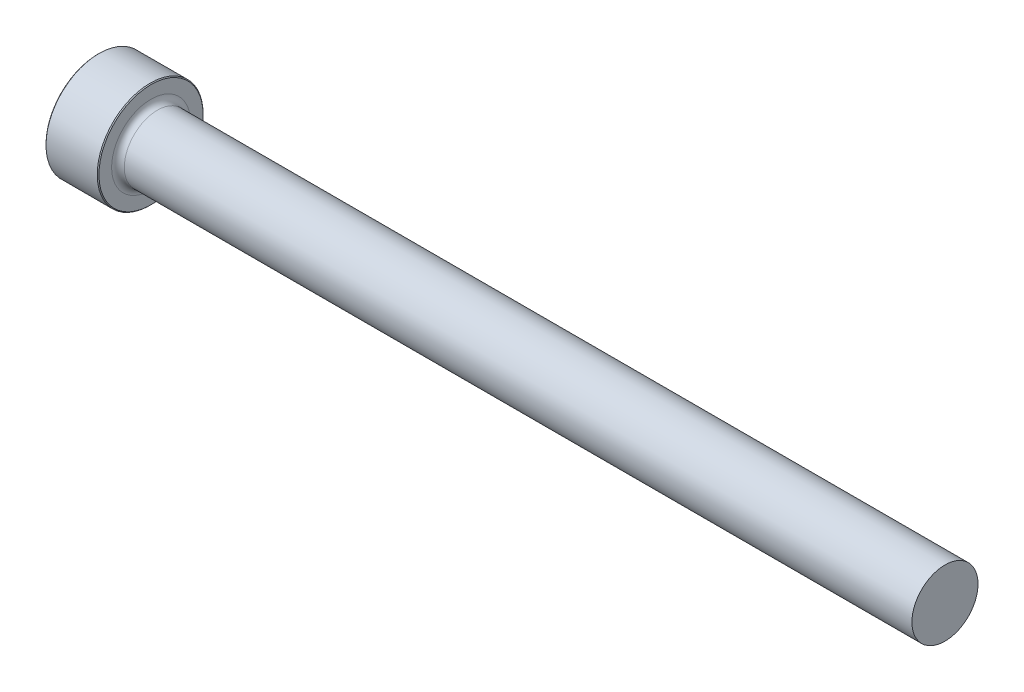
ISO-10303-21;
HEADER;
FILE_DESCRIPTION(('STEP AP214'),'2;1');
FILE_NAME('part.step','',(''),(''),'','','');
FILE_SCHEMA(('AUTOMOTIVE_DESIGN { 1 0 10303 214 1 1 1 1 }'));
ENDSEC;
DATA;
#1=APPLICATION_CONTEXT('core data for automotive mechanical design processes');
#2=APPLICATION_PROTOCOL_DEFINITION('international standard','automotive_design',2000,#1);
#3=PRODUCT_CONTEXT('',#1,'mechanical');
#4=PRODUCT('Part','Part','',(#3));
#5=PRODUCT_RELATED_PRODUCT_CATEGORY('part','',(#4));
#6=PRODUCT_DEFINITION_FORMATION('','',#4);
#7=PRODUCT_DEFINITION_CONTEXT('part definition',#1,'design');
#8=PRODUCT_DEFINITION('design','',#6,#7);
#9=PRODUCT_DEFINITION_SHAPE('','',#8);
#10=(LENGTH_UNIT() NAMED_UNIT(*) SI_UNIT(.MILLI.,.METRE.));
#11=(NAMED_UNIT(*) PLANE_ANGLE_UNIT() SI_UNIT($,.RADIAN.));
#12=(NAMED_UNIT(*) SI_UNIT($,.STERADIAN.) SOLID_ANGLE_UNIT());
#13=UNCERTAINTY_MEASURE_WITH_UNIT(LENGTH_MEASURE(1.E-05),#10,'distance_accuracy_value','');
#14=(GEOMETRIC_REPRESENTATION_CONTEXT(3) GLOBAL_UNCERTAINTY_ASSIGNED_CONTEXT((#13)) GLOBAL_UNIT_ASSIGNED_CONTEXT((#10,
#11,#12)) REPRESENTATION_CONTEXT('',''));
#15=CARTESIAN_POINT('',(0.,0.,0.));
#16=DIRECTION('',(0.,0.,1.));
#17=DIRECTION('',(1.,0.,0.));
#18=AXIS2_PLACEMENT_3D('',#15,#16,#17);
#19=CARTESIAN_POINT('',(101.6,3.96493999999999,0.));
#20=DIRECTION('',(1.,0.,0.));
#21=DIRECTION('',(0.,1.,0.));
#22=AXIS2_PLACEMENT_3D('',#19,#20,#21);
#23=PLANE('',#22);
#24=CARTESIAN_POINT('',(101.6,0.,0.));
#25=DIRECTION('',(1.,0.,0.));
#26=DIRECTION('',(0.,1.,0.));
#27=AXIS2_PLACEMENT_3D('',#24,#25,#26);
#28=CIRCLE('',#27,3.96494);
#29=CARTESIAN_POINT('',(101.6,3.96493999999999,0.));
#30=VERTEX_POINT('',#29);
#31=EDGE_CURVE('E50',#30,#30,#28,.T.);
#32=ORIENTED_EDGE('',*,*,#31,.T.);
#33=EDGE_LOOP('',(#32));
#34=FACE_BOUND('',#33,.T.);
#35=ADVANCED_FACE('F30',(#34),#23,.T.);
#36=CARTESIAN_POINT('',(101.6,0.,0.));
#37=DIRECTION('',(1.,0.,0.));
#38=DIRECTION('',(0.,1.,0.));
#39=AXIS2_PLACEMENT_3D('',#36,#37,#38);
#40=CYLINDRICAL_SURFACE('',#39,3.96494);
#41=CARTESIAN_POINT('',(7.11199999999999,0.,0.));
#42=DIRECTION('',(1.,0.,0.));
#43=DIRECTION('',(0.,1.,0.));
#44=AXIS2_PLACEMENT_3D('',#41,#42,#43);
#45=CIRCLE('',#44,3.96493999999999);
#46=CARTESIAN_POINT('',(7.11199999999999,3.96493999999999,0.));
#47=VERTEX_POINT('',#46);
#48=EDGE_CURVE('E53',#47,#47,#45,.T.);
#49=ORIENTED_EDGE('',*,*,#48,.T.);
#50=EDGE_LOOP('',(#49));
#51=FACE_BOUND('',#50,.T.);
#52=ORIENTED_EDGE('',*,*,#31,.F.);
#53=EDGE_LOOP('',(#52));
#54=FACE_BOUND('',#53,.T.);
#55=ADVANCED_FACE('F74',(#51,#54),#40,.T.);
#56=CARTESIAN_POINT('',(7.112,0.,0.));
#57=DIRECTION('',(1.,0.,0.));
#58=DIRECTION('',(0.,1.,0.));
#59=AXIS2_PLACEMENT_3D('',#56,#57,#58);
#60=TOROIDAL_SURFACE('',#59,4.72693999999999,0.762);
#61=CARTESIAN_POINT('',(6.34999999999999,0.,0.));
#62=DIRECTION('',(1.,0.,0.));
#63=DIRECTION('',(0.,1.,0.));
#64=AXIS2_PLACEMENT_3D('',#61,#62,#63);
#65=CIRCLE('',#64,4.72693999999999);
#66=CARTESIAN_POINT('',(6.34999999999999,4.72693999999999,0.));
#67=VERTEX_POINT('',#66);
#68=EDGE_CURVE('E56',#67,#67,#65,.T.);
#69=ORIENTED_EDGE('',*,*,#68,.T.);
#70=EDGE_LOOP('',(#69));
#71=FACE_BOUND('',#70,.T.);
#72=ORIENTED_EDGE('',*,*,#48,.F.);
#73=EDGE_LOOP('',(#72));
#74=FACE_BOUND('',#73,.T.);
#75=ADVANCED_FACE('F60',(#71,#74),#60,.F.);
#76=CARTESIAN_POINT('',(6.35,6.35,0.));
#77=DIRECTION('',(1.,0.,0.));
#78=DIRECTION('',(0.,1.,0.));
#79=AXIS2_PLACEMENT_3D('',#76,#77,#78);
#80=PLANE('',#79);
#81=CARTESIAN_POINT('',(6.35,0.,0.));
#82=DIRECTION('',(1.,0.,0.));
#83=DIRECTION('',(0.,1.,0.));
#84=AXIS2_PLACEMENT_3D('',#81,#82,#83);
#85=CIRCLE('',#84,6.2484);
#86=CARTESIAN_POINT('',(6.35,6.2484,0.));
#87=VERTEX_POINT('',#86);
#88=EDGE_CURVE('E10',#87,#87,#85,.T.);
#89=ORIENTED_EDGE('',*,*,#88,.T.);
#90=EDGE_LOOP('',(#89));
#91=FACE_BOUND('',#90,.T.);
#92=ORIENTED_EDGE('',*,*,#68,.F.);
#93=EDGE_LOOP('',(#92));
#94=FACE_BOUND('',#93,.T.);
#95=ADVANCED_FACE('F63',(#91,#94),#80,.T.);
#96=CARTESIAN_POINT('',(101.6,0.,0.));
#97=DIRECTION('',(1.,0.,0.));
#98=DIRECTION('',(0.,1.,0.));
#99=AXIS2_PLACEMENT_3D('',#96,#97,#98);
#100=CYLINDRICAL_SURFACE('',#99,6.35);
#101=CARTESIAN_POINT('',(0.101599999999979,0.,0.));
#102=DIRECTION('',(-1.,0.,0.));
#103=DIRECTION('',(0.,-1.,0.));
#104=AXIS2_PLACEMENT_3D('',#101,#102,#103);
#105=CIRCLE('',#104,6.35);
#106=CARTESIAN_POINT('',(0.101599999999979,-6.35,0.));
#107=VERTEX_POINT('',#106);
#108=EDGE_CURVE('E41',#107,#107,#105,.F.);
#109=ORIENTED_EDGE('',*,*,#108,.T.);
#110=EDGE_LOOP('',(#109));
#111=FACE_BOUND('',#110,.T.);
#112=CARTESIAN_POINT('',(6.2484,0.,0.));
#113=DIRECTION('',(1.,0.,0.));
#114=DIRECTION('',(0.,1.,0.));
#115=AXIS2_PLACEMENT_3D('',#112,#113,#114);
#116=CIRCLE('',#115,6.35);
#117=CARTESIAN_POINT('',(6.2484,6.35,0.));
#118=VERTEX_POINT('',#117);
#119=EDGE_CURVE('E45',#118,#118,#116,.F.);
#120=ORIENTED_EDGE('',*,*,#119,.T.);
#121=EDGE_LOOP('',(#120));
#122=FACE_BOUND('',#121,.T.);
#123=ADVANCED_FACE('F65',(#111,#122),#100,.T.);
#124=CARTESIAN_POINT('',(0.,0.,0.));
#125=DIRECTION('',(-1.,0.,0.));
#126=DIRECTION('',(0.,-1.,0.));
#127=AXIS2_PLACEMENT_3D('',#124,#125,#126);
#128=PLANE('',#127);
#129=CARTESIAN_POINT('',(0.,0.,0.));
#130=DIRECTION('',(-1.,0.,0.));
#131=DIRECTION('',(0.,-1.,0.));
#132=AXIS2_PLACEMENT_3D('',#129,#130,#131);
#133=CIRCLE('',#132,6.24840000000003);
#134=CARTESIAN_POINT('',(0.,-6.24840000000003,0.));
#135=VERTEX_POINT('',#134);
#136=EDGE_CURVE('E37',#135,#135,#133,.T.);
#137=ORIENTED_EDGE('',*,*,#136,.T.);
#138=EDGE_LOOP('',(#137));
#139=FACE_BOUND('',#138,.T.);
#140=ADVANCED_FACE('F71',(#139),#128,.T.);
#141=CARTESIAN_POINT('',(0.101599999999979,0.,0.));
#142=DIRECTION('',(1.,0.,0.));
#143=DIRECTION('',(0.,1.,0.));
#144=AXIS2_PLACEMENT_3D('',#141,#142,#143);
#145=CONICAL_SURFACE('',#144,6.35,0.78539816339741);
#146=ORIENTED_EDGE('',*,*,#136,.F.);
#147=EDGE_LOOP('',(#146));
#148=FACE_BOUND('',#147,.T.);
#149=ORIENTED_EDGE('',*,*,#108,.F.);
#150=EDGE_LOOP('',(#149));
#151=FACE_BOUND('',#150,.T.);
#152=ADVANCED_FACE('F84',(#148,#151),#145,.T.);
#153=CARTESIAN_POINT('',(6.34999999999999,0.,0.));
#154=DIRECTION('',(-1.,0.,0.));
#155=DIRECTION('',(0.,-1.,0.));
#156=AXIS2_PLACEMENT_3D('',#153,#154,#155);
#157=CONICAL_SURFACE('',#156,6.2484,0.78539816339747);
#158=ORIENTED_EDGE('',*,*,#119,.F.);
#159=EDGE_LOOP('',(#158));
#160=FACE_BOUND('',#159,.T.);
#161=ORIENTED_EDGE('',*,*,#88,.F.);
#162=EDGE_LOOP('',(#161));
#163=FACE_BOUND('',#162,.T.);
#164=ADVANCED_FACE('F32',(#160,#163),#157,.T.);
#165=CLOSED_SHELL('',(#35,#55,#75,#95,#123,#140,#152,#164));
#166=MANIFOLD_SOLID_BREP('B2',#165);
#167=ADVANCED_BREP_SHAPE_REPRESENTATION('',(#18,#166),#14);
#168=SHAPE_DEFINITION_REPRESENTATION(#9,#167);
ENDSEC;
END-ISO-10303-21;
